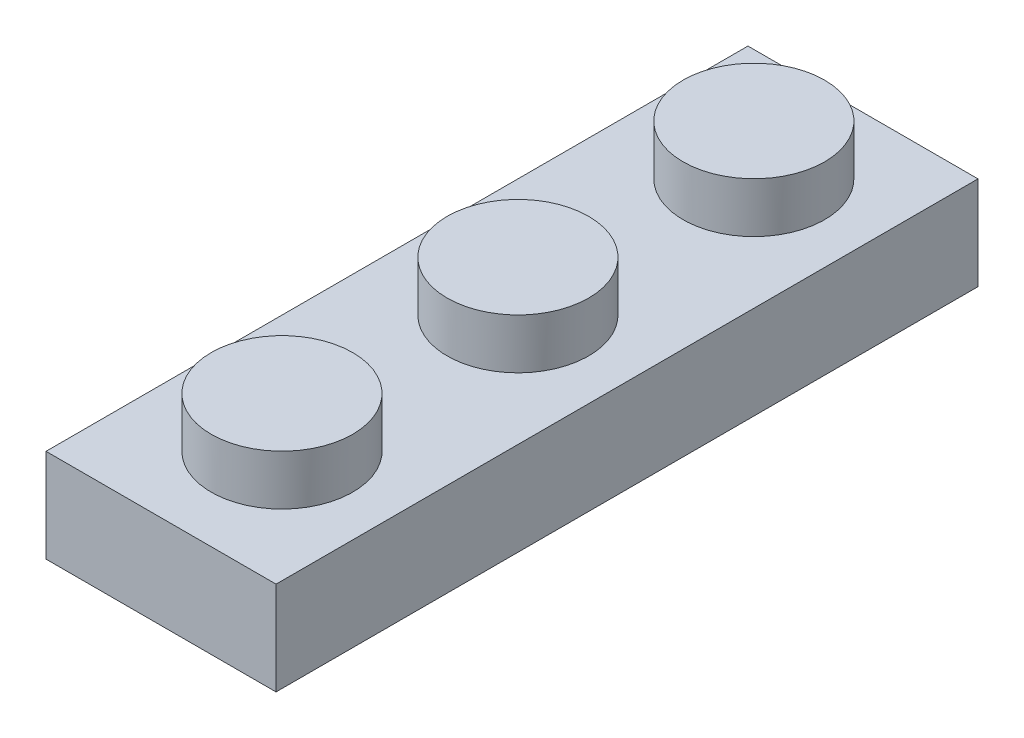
ISO-10303-21;
HEADER;
FILE_DESCRIPTION(('STEP AP214'),'2;1');
FILE_NAME('part.step','',(''),(''),'','','');
FILE_SCHEMA(('AUTOMOTIVE_DESIGN { 1 0 10303 214 1 1 1 1 }'));
ENDSEC;
DATA;
#1=APPLICATION_CONTEXT('core data for automotive mechanical design processes');
#2=APPLICATION_PROTOCOL_DEFINITION('international standard','automotive_design',2000,#1);
#3=PRODUCT_CONTEXT('',#1,'mechanical');
#4=PRODUCT('Part','Part','',(#3));
#5=PRODUCT_RELATED_PRODUCT_CATEGORY('part','',(#4));
#6=PRODUCT_DEFINITION_FORMATION('','',#4);
#7=PRODUCT_DEFINITION_CONTEXT('part definition',#1,'design');
#8=PRODUCT_DEFINITION('design','',#6,#7);
#9=PRODUCT_DEFINITION_SHAPE('','',#8);
#10=(LENGTH_UNIT() NAMED_UNIT(*) SI_UNIT(.MILLI.,.METRE.));
#11=(NAMED_UNIT(*) PLANE_ANGLE_UNIT() SI_UNIT($,.RADIAN.));
#12=(NAMED_UNIT(*) SI_UNIT($,.STERADIAN.) SOLID_ANGLE_UNIT());
#13=UNCERTAINTY_MEASURE_WITH_UNIT(LENGTH_MEASURE(1.E-05),#10,'distance_accuracy_value','');
#14=(GEOMETRIC_REPRESENTATION_CONTEXT(3) GLOBAL_UNCERTAINTY_ASSIGNED_CONTEXT((#13)) GLOBAL_UNIT_ASSIGNED_CONTEXT((#10,
#11,#12)) REPRESENTATION_CONTEXT('',''));
#15=CARTESIAN_POINT('',(0.,0.,0.));
#16=DIRECTION('',(0.,0.,1.));
#17=DIRECTION('',(1.,0.,0.));
#18=AXIS2_PLACEMENT_3D('',#15,#16,#17);
#19=CARTESIAN_POINT('',(0.,3.166,-23.8));
#20=DIRECTION('',(0.,-1.,0.));
#21=DIRECTION('',(0.,0.,-1.));
#22=AXIS2_PLACEMENT_3D('',#19,#20,#21);
#23=PLANE('',#22);
#24=CARTESIAN_POINT('',(4.,3.166,-12.));
#25=DIRECTION('',(0.,-1.,0.));
#26=DIRECTION('',(0.,0.,-1.));
#27=AXIS2_PLACEMENT_3D('',#24,#25,#26);
#28=CIRCLE('',#27,2.4);
#29=CARTESIAN_POINT('',(4.,3.166,-14.4));
#30=VERTEX_POINT('',#29);
#31=EDGE_CURVE('E45',#30,#30,#28,.F.);
#32=ORIENTED_EDGE('',*,*,#31,.F.);
#33=EDGE_LOOP('',(#32));
#34=FACE_BOUND('',#33,.T.);
#35=DIRECTION('',(0.,0.,1.));
#36=VECTOR('',#35,1.);
#37=CARTESIAN_POINT('',(0.,3.166,0.));
#38=LINE('',#37,#36);
#39=CARTESIAN_POINT('',(0.,3.166,-23.8));
#40=VERTEX_POINT('',#39);
#41=CARTESIAN_POINT('',(0.,3.166,0.));
#42=VERTEX_POINT('',#41);
#43=EDGE_CURVE('E255',#40,#42,#38,.T.);
#44=ORIENTED_EDGE('',*,*,#43,.T.);
#45=DIRECTION('',(1.,0.,0.));
#46=VECTOR('',#45,1.);
#47=CARTESIAN_POINT('',(0.,3.166,0.));
#48=LINE('',#47,#46);
#49=CARTESIAN_POINT('',(7.8,3.166,0.));
#50=VERTEX_POINT('',#49);
#51=EDGE_CURVE('E258',#42,#50,#48,.T.);
#52=ORIENTED_EDGE('',*,*,#51,.T.);
#53=DIRECTION('',(0.,0.,-1.));
#54=VECTOR('',#53,1.);
#55=CARTESIAN_POINT('',(7.8,3.166,0.));
#56=LINE('',#55,#54);
#57=CARTESIAN_POINT('',(7.8,3.166,-23.8));
#58=VERTEX_POINT('',#57);
#59=EDGE_CURVE('E261',#50,#58,#56,.T.);
#60=ORIENTED_EDGE('',*,*,#59,.T.);
#61=DIRECTION('',(-1.,0.,0.));
#62=VECTOR('',#61,1.);
#63=CARTESIAN_POINT('',(0.,3.166,-23.8));
#64=LINE('',#63,#62);
#65=EDGE_CURVE('E263',#58,#40,#64,.T.);
#66=ORIENTED_EDGE('',*,*,#65,.T.);
#67=EDGE_LOOP('',(#44,#52,#60,#66));
#68=FACE_BOUND('',#67,.T.);
#69=CARTESIAN_POINT('',(4.,3.166,-4.));
#70=DIRECTION('',(0.,-1.,0.));
#71=DIRECTION('',(0.,0.,-1.));
#72=AXIS2_PLACEMENT_3D('',#69,#70,#71);
#73=CIRCLE('',#72,2.4);
#74=CARTESIAN_POINT('',(4.,3.166,-6.4));
#75=VERTEX_POINT('',#74);
#76=EDGE_CURVE('E284',#75,#75,#73,.F.);
#77=ORIENTED_EDGE('',*,*,#76,.F.);
#78=EDGE_LOOP('',(#77));
#79=FACE_BOUND('',#78,.T.);
#80=CARTESIAN_POINT('',(4.,3.166,-20.));
#81=DIRECTION('',(0.,-1.,0.));
#82=DIRECTION('',(0.,0.,-1.));
#83=AXIS2_PLACEMENT_3D('',#80,#81,#82);
#84=CIRCLE('',#83,2.4);
#85=CARTESIAN_POINT('',(4.,3.166,-22.4));
#86=VERTEX_POINT('',#85);
#87=EDGE_CURVE('E11',#86,#86,#84,.F.);
#88=ORIENTED_EDGE('',*,*,#87,.F.);
#89=EDGE_LOOP('',(#88));
#90=FACE_BOUND('',#89,.T.);
#91=ADVANCED_FACE('F37',(#34,#68,#79,#90),#23,.F.);
#92=CARTESIAN_POINT('',(0.,3.166,0.));
#93=DIRECTION('',(1.,0.,0.));
#94=DIRECTION('',(0.,0.,-1.));
#95=AXIS2_PLACEMENT_3D('',#92,#93,#94);
#96=PLANE('',#95);
#97=DIRECTION('',(0.,0.,1.));
#98=VECTOR('',#97,1.);
#99=CARTESIAN_POINT('',(0.,0.,0.));
#100=LINE('',#99,#98);
#101=CARTESIAN_POINT('',(0.,0.,-23.8));
#102=VERTEX_POINT('',#101);
#103=CARTESIAN_POINT('',(0.,0.,0.));
#104=VERTEX_POINT('',#103);
#105=EDGE_CURVE('E254',#102,#104,#100,.T.);
#106=ORIENTED_EDGE('',*,*,#105,.T.);
#107=DIRECTION('',(0.,-1.,0.));
#108=VECTOR('',#107,1.);
#109=CARTESIAN_POINT('',(0.,3.166,0.));
#110=LINE('',#109,#108);
#111=EDGE_CURVE('E281',#42,#104,#110,.T.);
#112=ORIENTED_EDGE('',*,*,#111,.F.);
#113=ORIENTED_EDGE('',*,*,#43,.F.);
#114=DIRECTION('',(0.,-1.,0.));
#115=VECTOR('',#114,1.);
#116=CARTESIAN_POINT('',(0.,3.166,-23.8));
#117=LINE('',#116,#115);
#118=EDGE_CURVE('E265',#40,#102,#117,.T.);
#119=ORIENTED_EDGE('',*,*,#118,.T.);
#120=EDGE_LOOP('',(#106,#112,#113,#119));
#121=FACE_BOUND('',#120,.T.);
#122=ADVANCED_FACE('F39',(#121),#96,.F.);
#123=CARTESIAN_POINT('',(0.,3.166,0.));
#124=DIRECTION('',(0.,0.,-1.));
#125=DIRECTION('',(-1.,0.,0.));
#126=AXIS2_PLACEMENT_3D('',#123,#124,#125);
#127=PLANE('',#126);
#128=DIRECTION('',(1.,0.,0.));
#129=VECTOR('',#128,1.);
#130=CARTESIAN_POINT('',(0.,0.,0.));
#131=LINE('',#130,#129);
#132=CARTESIAN_POINT('',(7.8,0.,0.));
#133=VERTEX_POINT('',#132);
#134=EDGE_CURVE('E268',#104,#133,#131,.T.);
#135=ORIENTED_EDGE('',*,*,#134,.T.);
#136=DIRECTION('',(0.,-1.,0.));
#137=VECTOR('',#136,1.);
#138=CARTESIAN_POINT('',(7.8,3.166,0.));
#139=LINE('',#138,#137);
#140=EDGE_CURVE('E278',#50,#133,#139,.T.);
#141=ORIENTED_EDGE('',*,*,#140,.F.);
#142=ORIENTED_EDGE('',*,*,#51,.F.);
#143=ORIENTED_EDGE('',*,*,#111,.T.);
#144=EDGE_LOOP('',(#135,#141,#142,#143));
#145=FACE_BOUND('',#144,.T.);
#146=ADVANCED_FACE('F374',(#145),#127,.F.);
#147=CARTESIAN_POINT('',(7.8,3.166,0.));
#148=DIRECTION('',(-1.,0.,0.));
#149=DIRECTION('',(0.,0.,1.));
#150=AXIS2_PLACEMENT_3D('',#147,#148,#149);
#151=PLANE('',#150);
#152=DIRECTION('',(0.,0.,-1.));
#153=VECTOR('',#152,1.);
#154=CARTESIAN_POINT('',(7.8,0.,0.));
#155=LINE('',#154,#153);
#156=CARTESIAN_POINT('',(7.8,0.,-23.8));
#157=VERTEX_POINT('',#156);
#158=EDGE_CURVE('E270',#133,#157,#155,.T.);
#159=ORIENTED_EDGE('',*,*,#158,.T.);
#160=DIRECTION('',(0.,-1.,0.));
#161=VECTOR('',#160,1.);
#162=CARTESIAN_POINT('',(7.8,3.166,-23.8));
#163=LINE('',#162,#161);
#164=EDGE_CURVE('E275',#58,#157,#163,.T.);
#165=ORIENTED_EDGE('',*,*,#164,.F.);
#166=ORIENTED_EDGE('',*,*,#59,.F.);
#167=ORIENTED_EDGE('',*,*,#140,.T.);
#168=EDGE_LOOP('',(#159,#165,#166,#167));
#169=FACE_BOUND('',#168,.T.);
#170=ADVANCED_FACE('F371',(#169),#151,.F.);
#171=CARTESIAN_POINT('',(0.,3.166,-23.8));
#172=DIRECTION('',(0.,0.,1.));
#173=DIRECTION('',(1.,0.,0.));
#174=AXIS2_PLACEMENT_3D('',#171,#172,#173);
#175=PLANE('',#174);
#176=DIRECTION('',(-1.,0.,0.));
#177=VECTOR('',#176,1.);
#178=CARTESIAN_POINT('',(0.,0.,-23.8));
#179=LINE('',#178,#177);
#180=EDGE_CURVE('E259',#157,#102,#179,.T.);
#181=ORIENTED_EDGE('',*,*,#180,.T.);
#182=ORIENTED_EDGE('',*,*,#118,.F.);
#183=ORIENTED_EDGE('',*,*,#65,.F.);
#184=ORIENTED_EDGE('',*,*,#164,.T.);
#185=EDGE_LOOP('',(#181,#182,#183,#184));
#186=FACE_BOUND('',#185,.T.);
#187=ADVANCED_FACE('F367',(#186),#175,.F.);
#188=CARTESIAN_POINT('',(0.,0.,-23.8));
#189=DIRECTION('',(0.,-1.,0.));
#190=DIRECTION('',(0.,0.,-1.));
#191=AXIS2_PLACEMENT_3D('',#188,#189,#190);
#192=PLANE('',#191);
#193=DIRECTION('',(0.,0.,-1.));
#194=VECTOR('',#193,1.);
#195=CARTESIAN_POINT('',(1.45,0.,-1.45));
#196=LINE('',#195,#194);
#197=CARTESIAN_POINT('',(1.45,0.,-1.45));
#198=VERTEX_POINT('',#197);
#199=CARTESIAN_POINT('',(1.45,0.,-6.35));
#200=VERTEX_POINT('',#199);
#201=EDGE_CURVE('E52',#198,#200,#196,.T.);
#202=ORIENTED_EDGE('',*,*,#201,.F.);
#203=DIRECTION('',(-1.,0.,0.));
#204=VECTOR('',#203,1.);
#205=CARTESIAN_POINT('',(1.45,0.,-1.45));
#206=LINE('',#205,#204);
#207=CARTESIAN_POINT('',(6.35,0.,-1.45));
#208=VERTEX_POINT('',#207);
#209=EDGE_CURVE('E182',#208,#198,#206,.T.);
#210=ORIENTED_EDGE('',*,*,#209,.F.);
#211=DIRECTION('',(0.,0.,1.));
#212=VECTOR('',#211,1.);
#213=CARTESIAN_POINT('',(6.35,0.,-1.45));
#214=LINE('',#213,#212);
#215=CARTESIAN_POINT('',(6.35,0.,-6.35));
#216=VERTEX_POINT('',#215);
#217=EDGE_CURVE('E173',#216,#208,#214,.T.);
#218=ORIENTED_EDGE('',*,*,#217,.F.);
#219=DIRECTION('',(1.,0.,0.));
#220=VECTOR('',#219,1.);
#221=CARTESIAN_POINT('',(1.45,0.,-6.35));
#222=LINE('',#221,#220);
#223=EDGE_CURVE('E161',#200,#216,#222,.T.);
#224=ORIENTED_EDGE('',*,*,#223,.F.);
#225=EDGE_LOOP('',(#202,#210,#218,#224));
#226=FACE_BOUND('',#225,.T.);
#227=DIRECTION('',(0.,0.,-1.));
#228=VECTOR('',#227,1.);
#229=CARTESIAN_POINT('',(1.45,0.,-9.45));
#230=LINE('',#229,#228);
#231=CARTESIAN_POINT('',(1.45,0.,-9.45));
#232=VERTEX_POINT('',#231);
#233=CARTESIAN_POINT('',(1.45,0.,-14.35));
#234=VERTEX_POINT('',#233);
#235=EDGE_CURVE('E60',#232,#234,#230,.T.);
#236=ORIENTED_EDGE('',*,*,#235,.F.);
#237=DIRECTION('',(-1.,0.,0.));
#238=VECTOR('',#237,1.);
#239=CARTESIAN_POINT('',(1.45,0.,-9.45));
#240=LINE('',#239,#238);
#241=CARTESIAN_POINT('',(6.35,0.,-9.45));
#242=VERTEX_POINT('',#241);
#243=EDGE_CURVE('E211',#242,#232,#240,.T.);
#244=ORIENTED_EDGE('',*,*,#243,.F.);
#245=DIRECTION('',(0.,0.,1.));
#246=VECTOR('',#245,1.);
#247=CARTESIAN_POINT('',(6.35,0.,-9.45));
#248=LINE('',#247,#246);
#249=CARTESIAN_POINT('',(6.35,0.,-14.35));
#250=VERTEX_POINT('',#249);
#251=EDGE_CURVE('E206',#250,#242,#248,.T.);
#252=ORIENTED_EDGE('',*,*,#251,.F.);
#253=DIRECTION('',(1.,0.,0.));
#254=VECTOR('',#253,1.);
#255=CARTESIAN_POINT('',(1.45,0.,-14.35));
#256=LINE('',#255,#254);
#257=EDGE_CURVE('E190',#234,#250,#256,.T.);
#258=ORIENTED_EDGE('',*,*,#257,.F.);
#259=EDGE_LOOP('',(#236,#244,#252,#258));
#260=FACE_BOUND('',#259,.T.);
#261=DIRECTION('',(0.,0.,-1.));
#262=VECTOR('',#261,1.);
#263=CARTESIAN_POINT('',(1.45,0.,-17.45));
#264=LINE('',#263,#262);
#265=CARTESIAN_POINT('',(1.45,0.,-17.45));
#266=VERTEX_POINT('',#265);
#267=CARTESIAN_POINT('',(1.45,0.,-22.35));
#268=VERTEX_POINT('',#267);
#269=EDGE_CURVE('E219',#266,#268,#264,.T.);
#270=ORIENTED_EDGE('',*,*,#269,.F.);
#271=DIRECTION('',(-1.,0.,0.));
#272=VECTOR('',#271,1.);
#273=CARTESIAN_POINT('',(1.45,0.,-17.45));
#274=LINE('',#273,#272);
#275=CARTESIAN_POINT('',(6.35,0.,-17.45));
#276=VERTEX_POINT('',#275);
#277=EDGE_CURVE('E224',#276,#266,#274,.T.);
#278=ORIENTED_EDGE('',*,*,#277,.F.);
#279=DIRECTION('',(0.,0.,1.));
#280=VECTOR('',#279,1.);
#281=CARTESIAN_POINT('',(6.35,0.,-17.45));
#282=LINE('',#281,#280);
#283=CARTESIAN_POINT('',(6.35,0.,-22.35));
#284=VERTEX_POINT('',#283);
#285=EDGE_CURVE('E238',#284,#276,#282,.T.);
#286=ORIENTED_EDGE('',*,*,#285,.F.);
#287=DIRECTION('',(1.,0.,0.));
#288=VECTOR('',#287,1.);
#289=CARTESIAN_POINT('',(1.45,0.,-22.35));
#290=LINE('',#289,#288);
#291=EDGE_CURVE('E235',#268,#284,#290,.T.);
#292=ORIENTED_EDGE('',*,*,#291,.F.);
#293=EDGE_LOOP('',(#270,#278,#286,#292));
#294=FACE_BOUND('',#293,.T.);
#295=ORIENTED_EDGE('',*,*,#105,.F.);
#296=ORIENTED_EDGE('',*,*,#180,.F.);
#297=ORIENTED_EDGE('',*,*,#158,.F.);
#298=ORIENTED_EDGE('',*,*,#134,.F.);
#299=EDGE_LOOP('',(#295,#296,#297,#298));
#300=FACE_BOUND('',#299,.T.);
#301=ADVANCED_FACE('F362',(#226,#260,#294,#300),#192,.T.);
#302=CARTESIAN_POINT('',(4.,4.866,-4.));
#303=DIRECTION('',(0.,-1.,0.));
#304=DIRECTION('',(0.,0.,-1.));
#305=AXIS2_PLACEMENT_3D('',#302,#303,#304);
#306=CYLINDRICAL_SURFACE('',#305,2.4);
#307=CARTESIAN_POINT('',(4.,4.866,-4.));
#308=DIRECTION('',(0.,1.,0.));
#309=DIRECTION('',(0.,0.,1.));
#310=AXIS2_PLACEMENT_3D('',#307,#308,#309);
#311=CIRCLE('',#310,2.4);
#312=CARTESIAN_POINT('',(4.,4.866,-1.6));
#313=VERTEX_POINT('',#312);
#314=EDGE_CURVE('E245',#313,#313,#311,.T.);
#315=ORIENTED_EDGE('',*,*,#314,.F.);
#316=EDGE_LOOP('',(#315));
#317=FACE_BOUND('',#316,.T.);
#318=ORIENTED_EDGE('',*,*,#76,.T.);
#319=EDGE_LOOP('',(#318));
#320=FACE_BOUND('',#319,.T.);
#321=ADVANCED_FACE('F359',(#317,#320),#306,.T.);
#322=CARTESIAN_POINT('',(4.,4.866,-4.));
#323=DIRECTION('',(0.,1.,0.));
#324=DIRECTION('',(0.,0.,1.));
#325=AXIS2_PLACEMENT_3D('',#322,#323,#324);
#326=PLANE('',#325);
#327=ORIENTED_EDGE('',*,*,#314,.T.);
#328=EDGE_LOOP('',(#327));
#329=FACE_BOUND('',#328,.T.);
#330=ADVANCED_FACE('F355',(#329),#326,.T.);
#331=CARTESIAN_POINT('',(1.45,2.5,-17.45));
#332=DIRECTION('',(-1.,0.,0.));
#333=DIRECTION('',(0.,0.,1.));
#334=AXIS2_PLACEMENT_3D('',#331,#332,#333);
#335=PLANE('',#334);
#336=ORIENTED_EDGE('',*,*,#269,.T.);
#337=DIRECTION('',(0.,-1.,0.));
#338=VECTOR('',#337,1.);
#339=CARTESIAN_POINT('',(1.45,2.5,-22.35));
#340=LINE('',#339,#338);
#341=CARTESIAN_POINT('',(1.45,2.5,-22.35));
#342=VERTEX_POINT('',#341);
#343=EDGE_CURVE('E233',#342,#268,#340,.T.);
#344=ORIENTED_EDGE('',*,*,#343,.F.);
#345=DIRECTION('',(0.,0.,-1.));
#346=VECTOR('',#345,1.);
#347=CARTESIAN_POINT('',(1.45,2.5,-17.45));
#348=LINE('',#347,#346);
#349=CARTESIAN_POINT('',(1.45,2.5,-17.45));
#350=VERTEX_POINT('',#349);
#351=EDGE_CURVE('E220',#350,#342,#348,.T.);
#352=ORIENTED_EDGE('',*,*,#351,.F.);
#353=DIRECTION('',(0.,-1.,0.));
#354=VECTOR('',#353,1.);
#355=CARTESIAN_POINT('',(1.45,2.5,-17.45));
#356=LINE('',#355,#354);
#357=EDGE_CURVE('E243',#350,#266,#356,.T.);
#358=ORIENTED_EDGE('',*,*,#357,.T.);
#359=EDGE_LOOP('',(#336,#344,#352,#358));
#360=FACE_BOUND('',#359,.T.);
#361=ADVANCED_FACE('F345',(#360),#335,.F.);
#362=CARTESIAN_POINT('',(1.45,2.5,-17.45));
#363=DIRECTION('',(0.,0.,1.));
#364=DIRECTION('',(1.,0.,0.));
#365=AXIS2_PLACEMENT_3D('',#362,#363,#364);
#366=PLANE('',#365);
#367=ORIENTED_EDGE('',*,*,#277,.T.);
#368=ORIENTED_EDGE('',*,*,#357,.F.);
#369=DIRECTION('',(-1.,0.,0.));
#370=VECTOR('',#369,1.);
#371=CARTESIAN_POINT('',(1.45,2.5,-17.45));
#372=LINE('',#371,#370);
#373=CARTESIAN_POINT('',(6.35,2.5,-17.45));
#374=VERTEX_POINT('',#373);
#375=EDGE_CURVE('E230',#374,#350,#372,.T.);
#376=ORIENTED_EDGE('',*,*,#375,.F.);
#377=DIRECTION('',(0.,-1.,0.));
#378=VECTOR('',#377,1.);
#379=CARTESIAN_POINT('',(6.35,2.5,-17.45));
#380=LINE('',#379,#378);
#381=EDGE_CURVE('E246',#374,#276,#380,.T.);
#382=ORIENTED_EDGE('',*,*,#381,.T.);
#383=EDGE_LOOP('',(#367,#368,#376,#382));
#384=FACE_BOUND('',#383,.T.);
#385=ADVANCED_FACE('F341',(#384),#366,.F.);
#386=CARTESIAN_POINT('',(6.35,2.5,-17.45));
#387=DIRECTION('',(1.,0.,0.));
#388=DIRECTION('',(0.,0.,-1.));
#389=AXIS2_PLACEMENT_3D('',#386,#387,#388);
#390=PLANE('',#389);
#391=ORIENTED_EDGE('',*,*,#285,.T.);
#392=ORIENTED_EDGE('',*,*,#381,.F.);
#393=DIRECTION('',(0.,0.,1.));
#394=VECTOR('',#393,1.);
#395=CARTESIAN_POINT('',(6.35,2.5,-17.45));
#396=LINE('',#395,#394);
#397=CARTESIAN_POINT('',(6.35,2.5,-22.35));
#398=VERTEX_POINT('',#397);
#399=EDGE_CURVE('E227',#398,#374,#396,.T.);
#400=ORIENTED_EDGE('',*,*,#399,.F.);
#401=DIRECTION('',(0.,-1.,0.));
#402=VECTOR('',#401,1.);
#403=CARTESIAN_POINT('',(6.35,2.5,-22.35));
#404=LINE('',#403,#402);
#405=EDGE_CURVE('E248',#398,#284,#404,.T.);
#406=ORIENTED_EDGE('',*,*,#405,.T.);
#407=EDGE_LOOP('',(#391,#392,#400,#406));
#408=FACE_BOUND('',#407,.T.);
#409=ADVANCED_FACE('F344',(#408),#390,.F.);
#410=CARTESIAN_POINT('',(1.45,2.5,-22.35));
#411=DIRECTION('',(0.,0.,-1.));
#412=DIRECTION('',(-1.,0.,0.));
#413=AXIS2_PLACEMENT_3D('',#410,#411,#412);
#414=PLANE('',#413);
#415=ORIENTED_EDGE('',*,*,#291,.T.);
#416=ORIENTED_EDGE('',*,*,#405,.F.);
#417=DIRECTION('',(1.,0.,0.));
#418=VECTOR('',#417,1.);
#419=CARTESIAN_POINT('',(1.45,2.5,-22.35));
#420=LINE('',#419,#418);
#421=EDGE_CURVE('E223',#342,#398,#420,.T.);
#422=ORIENTED_EDGE('',*,*,#421,.F.);
#423=ORIENTED_EDGE('',*,*,#343,.T.);
#424=EDGE_LOOP('',(#415,#416,#422,#423));
#425=FACE_BOUND('',#424,.T.);
#426=ADVANCED_FACE('F339',(#425),#414,.F.);
#427=CARTESIAN_POINT('',(1.45,2.5,-22.35));
#428=DIRECTION('',(0.,-1.,0.));
#429=DIRECTION('',(0.,0.,-1.));
#430=AXIS2_PLACEMENT_3D('',#427,#428,#429);
#431=PLANE('',#430);
#432=ORIENTED_EDGE('',*,*,#351,.T.);
#433=ORIENTED_EDGE('',*,*,#421,.T.);
#434=ORIENTED_EDGE('',*,*,#399,.T.);
#435=ORIENTED_EDGE('',*,*,#375,.T.);
#436=EDGE_LOOP('',(#432,#433,#434,#435));
#437=FACE_BOUND('',#436,.T.);
#438=ADVANCED_FACE('F331',(#437),#431,.T.);
#439=CARTESIAN_POINT('',(4.,4.866,-12.));
#440=DIRECTION('',(0.,-1.,0.));
#441=DIRECTION('',(0.,0.,-1.));
#442=AXIS2_PLACEMENT_3D('',#439,#440,#441);
#443=CYLINDRICAL_SURFACE('',#442,2.4);
#444=CARTESIAN_POINT('',(4.,4.866,-12.));
#445=DIRECTION('',(0.,1.,0.));
#446=DIRECTION('',(0.,0.,1.));
#447=AXIS2_PLACEMENT_3D('',#444,#445,#446);
#448=CIRCLE('',#447,2.4);
#449=CARTESIAN_POINT('',(4.,4.866,-9.6));
#450=VERTEX_POINT('',#449);
#451=EDGE_CURVE('E216',#450,#450,#448,.T.);
#452=ORIENTED_EDGE('',*,*,#451,.F.);
#453=EDGE_LOOP('',(#452));
#454=FACE_BOUND('',#453,.T.);
#455=ORIENTED_EDGE('',*,*,#31,.T.);
#456=EDGE_LOOP('',(#455));
#457=FACE_BOUND('',#456,.T.);
#458=ADVANCED_FACE('F289',(#454,#457),#443,.T.);
#459=CARTESIAN_POINT('',(4.,4.866,-12.));
#460=DIRECTION('',(0.,1.,0.));
#461=DIRECTION('',(0.,0.,1.));
#462=AXIS2_PLACEMENT_3D('',#459,#460,#461);
#463=PLANE('',#462);
#464=ORIENTED_EDGE('',*,*,#451,.T.);
#465=EDGE_LOOP('',(#464));
#466=FACE_BOUND('',#465,.T.);
#467=ADVANCED_FACE('F320',(#466),#463,.T.);
#468=CARTESIAN_POINT('',(1.45,2.5,-9.45));
#469=DIRECTION('',(-1.,0.,0.));
#470=DIRECTION('',(0.,0.,1.));
#471=AXIS2_PLACEMENT_3D('',#468,#469,#470);
#472=PLANE('',#471);
#473=ORIENTED_EDGE('',*,*,#235,.T.);
#474=DIRECTION('',(0.,-1.,0.));
#475=VECTOR('',#474,1.);
#476=CARTESIAN_POINT('',(1.45,2.5,-14.35));
#477=LINE('',#476,#475);
#478=CARTESIAN_POINT('',(1.45,2.5,-14.35));
#479=VERTEX_POINT('',#478);
#480=EDGE_CURVE('E204',#479,#234,#477,.T.);
#481=ORIENTED_EDGE('',*,*,#480,.F.);
#482=DIRECTION('',(0.,0.,-1.));
#483=VECTOR('',#482,1.);
#484=CARTESIAN_POINT('',(1.45,2.5,-9.45));
#485=LINE('',#484,#483);
#486=CARTESIAN_POINT('',(1.45,2.5,-9.45));
#487=VERTEX_POINT('',#486);
#488=EDGE_CURVE('E192',#487,#479,#485,.T.);
#489=ORIENTED_EDGE('',*,*,#488,.F.);
#490=DIRECTION('',(0.,-1.,0.));
#491=VECTOR('',#490,1.);
#492=CARTESIAN_POINT('',(1.45,2.5,-9.45));
#493=LINE('',#492,#491);
#494=EDGE_CURVE('E213',#487,#232,#493,.T.);
#495=ORIENTED_EDGE('',*,*,#494,.T.);
#496=EDGE_LOOP('',(#473,#481,#489,#495));
#497=FACE_BOUND('',#496,.T.);
#498=ADVANCED_FACE('F307',(#497),#472,.F.);
#499=CARTESIAN_POINT('',(1.45,2.5,-9.45));
#500=DIRECTION('',(0.,0.,1.));
#501=DIRECTION('',(1.,0.,0.));
#502=AXIS2_PLACEMENT_3D('',#499,#500,#501);
#503=PLANE('',#502);
#504=ORIENTED_EDGE('',*,*,#243,.T.);
#505=ORIENTED_EDGE('',*,*,#494,.F.);
#506=DIRECTION('',(-1.,0.,0.));
#507=VECTOR('',#506,1.);
#508=CARTESIAN_POINT('',(1.45,2.5,-9.45));
#509=LINE('',#508,#507);
#510=CARTESIAN_POINT('',(6.35,2.5,-9.45));
#511=VERTEX_POINT('',#510);
#512=EDGE_CURVE('E198',#511,#487,#509,.T.);
#513=ORIENTED_EDGE('',*,*,#512,.F.);
#514=DIRECTION('',(0.,-1.,0.));
#515=VECTOR('',#514,1.);
#516=CARTESIAN_POINT('',(6.35,2.5,-9.45));
#517=LINE('',#516,#515);
#518=EDGE_CURVE('E208',#511,#242,#517,.T.);
#519=ORIENTED_EDGE('',*,*,#518,.T.);
#520=EDGE_LOOP('',(#504,#505,#513,#519));
#521=FACE_BOUND('',#520,.T.);
#522=ADVANCED_FACE('F319',(#521),#503,.F.);
#523=CARTESIAN_POINT('',(6.35,2.5,-9.45));
#524=DIRECTION('',(1.,0.,0.));
#525=DIRECTION('',(0.,0.,-1.));
#526=AXIS2_PLACEMENT_3D('',#523,#524,#525);
#527=PLANE('',#526);
#528=ORIENTED_EDGE('',*,*,#251,.T.);
#529=ORIENTED_EDGE('',*,*,#518,.F.);
#530=DIRECTION('',(0.,0.,1.));
#531=VECTOR('',#530,1.);
#532=CARTESIAN_POINT('',(6.35,2.5,-9.45));
#533=LINE('',#532,#531);
#534=CARTESIAN_POINT('',(6.35,2.5,-14.35));
#535=VERTEX_POINT('',#534);
#536=EDGE_CURVE('E196',#535,#511,#533,.T.);
#537=ORIENTED_EDGE('',*,*,#536,.F.);
#538=DIRECTION('',(0.,-1.,0.));
#539=VECTOR('',#538,1.);
#540=CARTESIAN_POINT('',(6.35,2.5,-14.35));
#541=LINE('',#540,#539);
#542=EDGE_CURVE('E201',#535,#250,#541,.T.);
#543=ORIENTED_EDGE('',*,*,#542,.T.);
#544=EDGE_LOOP('',(#528,#529,#537,#543));
#545=FACE_BOUND('',#544,.T.);
#546=ADVANCED_FACE('F326',(#545),#527,.F.);
#547=CARTESIAN_POINT('',(1.45,2.5,-14.35));
#548=DIRECTION('',(0.,0.,-1.));
#549=DIRECTION('',(-1.,0.,0.));
#550=AXIS2_PLACEMENT_3D('',#547,#548,#549);
#551=PLANE('',#550);
#552=ORIENTED_EDGE('',*,*,#257,.T.);
#553=ORIENTED_EDGE('',*,*,#542,.F.);
#554=DIRECTION('',(1.,0.,0.));
#555=VECTOR('',#554,1.);
#556=CARTESIAN_POINT('',(1.45,2.5,-14.35));
#557=LINE('',#556,#555);
#558=EDGE_CURVE('E194',#479,#535,#557,.T.);
#559=ORIENTED_EDGE('',*,*,#558,.F.);
#560=ORIENTED_EDGE('',*,*,#480,.T.);
#561=EDGE_LOOP('',(#552,#553,#559,#560));
#562=FACE_BOUND('',#561,.T.);
#563=ADVANCED_FACE('F314',(#562),#551,.F.);
#564=CARTESIAN_POINT('',(1.45,2.5,-14.35));
#565=DIRECTION('',(0.,-1.,0.));
#566=DIRECTION('',(0.,0.,-1.));
#567=AXIS2_PLACEMENT_3D('',#564,#565,#566);
#568=PLANE('',#567);
#569=ORIENTED_EDGE('',*,*,#488,.T.);
#570=ORIENTED_EDGE('',*,*,#558,.T.);
#571=ORIENTED_EDGE('',*,*,#536,.T.);
#572=ORIENTED_EDGE('',*,*,#512,.T.);
#573=EDGE_LOOP('',(#569,#570,#571,#572));
#574=FACE_BOUND('',#573,.T.);
#575=ADVANCED_FACE('F304',(#574),#568,.T.);
#576=CARTESIAN_POINT('',(4.,4.866,-20.));
#577=DIRECTION('',(0.,-1.,0.));
#578=DIRECTION('',(0.,0.,-1.));
#579=AXIS2_PLACEMENT_3D('',#576,#577,#578);
#580=CYLINDRICAL_SURFACE('',#579,2.4);
#581=CARTESIAN_POINT('',(4.,4.866,-20.));
#582=DIRECTION('',(0.,1.,0.));
#583=DIRECTION('',(0.,0.,1.));
#584=AXIS2_PLACEMENT_3D('',#581,#582,#583);
#585=CIRCLE('',#584,2.4);
#586=CARTESIAN_POINT('',(4.,4.866,-17.6));
#587=VERTEX_POINT('',#586);
#588=EDGE_CURVE('E187',#587,#587,#585,.T.);
#589=ORIENTED_EDGE('',*,*,#588,.F.);
#590=EDGE_LOOP('',(#589));
#591=FACE_BOUND('',#590,.T.);
#592=ORIENTED_EDGE('',*,*,#87,.T.);
#593=EDGE_LOOP('',(#592));
#594=FACE_BOUND('',#593,.T.);
#595=ADVANCED_FACE('F301',(#591,#594),#580,.T.);
#596=CARTESIAN_POINT('',(4.,4.866,-20.));
#597=DIRECTION('',(0.,1.,0.));
#598=DIRECTION('',(0.,0.,1.));
#599=AXIS2_PLACEMENT_3D('',#596,#597,#598);
#600=PLANE('',#599);
#601=ORIENTED_EDGE('',*,*,#588,.T.);
#602=EDGE_LOOP('',(#601));
#603=FACE_BOUND('',#602,.T.);
#604=ADVANCED_FACE('F303',(#603),#600,.T.);
#605=CARTESIAN_POINT('',(1.45,2.5,-1.45));
#606=DIRECTION('',(-1.,0.,0.));
#607=DIRECTION('',(0.,0.,1.));
#608=AXIS2_PLACEMENT_3D('',#605,#606,#607);
#609=PLANE('',#608);
#610=ORIENTED_EDGE('',*,*,#201,.T.);
#611=DIRECTION('',(0.,-1.,0.));
#612=VECTOR('',#611,1.);
#613=CARTESIAN_POINT('',(1.45,2.5,-6.35));
#614=LINE('',#613,#612);
#615=CARTESIAN_POINT('',(1.45,2.5,-6.35));
#616=VERTEX_POINT('',#615);
#617=EDGE_CURVE('E166',#616,#200,#614,.T.);
#618=ORIENTED_EDGE('',*,*,#617,.F.);
#619=DIRECTION('',(0.,0.,-1.));
#620=VECTOR('',#619,1.);
#621=CARTESIAN_POINT('',(1.45,2.5,-1.45));
#622=LINE('',#621,#620);
#623=CARTESIAN_POINT('',(1.45,2.5,-1.45));
#624=VERTEX_POINT('',#623);
#625=EDGE_CURVE('E153',#624,#616,#622,.T.);
#626=ORIENTED_EDGE('',*,*,#625,.F.);
#627=DIRECTION('',(0.,-1.,0.));
#628=VECTOR('',#627,1.);
#629=CARTESIAN_POINT('',(1.45,2.5,-1.45));
#630=LINE('',#629,#628);
#631=EDGE_CURVE('E184',#624,#198,#630,.T.);
#632=ORIENTED_EDGE('',*,*,#631,.T.);
#633=EDGE_LOOP('',(#610,#618,#626,#632));
#634=FACE_BOUND('',#633,.T.);
#635=ADVANCED_FACE('F172',(#634),#609,.F.);
#636=CARTESIAN_POINT('',(1.45,2.5,-1.45));
#637=DIRECTION('',(0.,0.,1.));
#638=DIRECTION('',(1.,0.,0.));
#639=AXIS2_PLACEMENT_3D('',#636,#637,#638);
#640=PLANE('',#639);
#641=ORIENTED_EDGE('',*,*,#209,.T.);
#642=ORIENTED_EDGE('',*,*,#631,.F.);
#643=DIRECTION('',(-1.,0.,0.));
#644=VECTOR('',#643,1.);
#645=CARTESIAN_POINT('',(1.45,2.5,-1.45));
#646=LINE('',#645,#644);
#647=CARTESIAN_POINT('',(6.35,2.5,-1.45));
#648=VERTEX_POINT('',#647);
#649=EDGE_CURVE('E159',#648,#624,#646,.T.);
#650=ORIENTED_EDGE('',*,*,#649,.F.);
#651=DIRECTION('',(0.,-1.,0.));
#652=VECTOR('',#651,1.);
#653=CARTESIAN_POINT('',(6.35,2.5,-1.45));
#654=LINE('',#653,#652);
#655=EDGE_CURVE('E175',#648,#208,#654,.T.);
#656=ORIENTED_EDGE('',*,*,#655,.T.);
#657=EDGE_LOOP('',(#641,#642,#650,#656));
#658=FACE_BOUND('',#657,.T.);
#659=ADVANCED_FACE('F428',(#658),#640,.F.);
#660=CARTESIAN_POINT('',(6.35,2.5,-1.45));
#661=DIRECTION('',(1.,0.,0.));
#662=DIRECTION('',(0.,0.,-1.));
#663=AXIS2_PLACEMENT_3D('',#660,#661,#662);
#664=PLANE('',#663);
#665=ORIENTED_EDGE('',*,*,#217,.T.);
#666=ORIENTED_EDGE('',*,*,#655,.F.);
#667=DIRECTION('',(0.,0.,1.));
#668=VECTOR('',#667,1.);
#669=CARTESIAN_POINT('',(6.35,2.5,-1.45));
#670=LINE('',#669,#668);
#671=CARTESIAN_POINT('',(6.35,2.5,-6.35));
#672=VERTEX_POINT('',#671);
#673=EDGE_CURVE('E170',#672,#648,#670,.T.);
#674=ORIENTED_EDGE('',*,*,#673,.F.);
#675=DIRECTION('',(0.,-1.,0.));
#676=VECTOR('',#675,1.);
#677=CARTESIAN_POINT('',(6.35,2.5,-6.35));
#678=LINE('',#677,#676);
#679=EDGE_CURVE('E169',#672,#216,#678,.T.);
#680=ORIENTED_EDGE('',*,*,#679,.T.);
#681=EDGE_LOOP('',(#665,#666,#674,#680));
#682=FACE_BOUND('',#681,.T.);
#683=ADVANCED_FACE('F437',(#682),#664,.F.);
#684=CARTESIAN_POINT('',(1.45,2.5,-6.35));
#685=DIRECTION('',(0.,0.,-1.));
#686=DIRECTION('',(-1.,0.,0.));
#687=AXIS2_PLACEMENT_3D('',#684,#685,#686);
#688=PLANE('',#687);
#689=ORIENTED_EDGE('',*,*,#223,.T.);
#690=ORIENTED_EDGE('',*,*,#679,.F.);
#691=DIRECTION('',(1.,0.,0.));
#692=VECTOR('',#691,1.);
#693=CARTESIAN_POINT('',(1.45,2.5,-6.35));
#694=LINE('',#693,#692);
#695=EDGE_CURVE('E156',#616,#672,#694,.T.);
#696=ORIENTED_EDGE('',*,*,#695,.F.);
#697=ORIENTED_EDGE('',*,*,#617,.T.);
#698=EDGE_LOOP('',(#689,#690,#696,#697));
#699=FACE_BOUND('',#698,.T.);
#700=ADVANCED_FACE('F165',(#699),#688,.F.);
#701=CARTESIAN_POINT('',(1.45,2.5,-6.35));
#702=DIRECTION('',(0.,-1.,0.));
#703=DIRECTION('',(0.,0.,-1.));
#704=AXIS2_PLACEMENT_3D('',#701,#702,#703);
#705=PLANE('',#704);
#706=ORIENTED_EDGE('',*,*,#625,.T.);
#707=ORIENTED_EDGE('',*,*,#695,.T.);
#708=ORIENTED_EDGE('',*,*,#673,.T.);
#709=ORIENTED_EDGE('',*,*,#649,.T.);
#710=EDGE_LOOP('',(#706,#707,#708,#709));
#711=FACE_BOUND('',#710,.T.);
#712=ADVANCED_FACE('F155',(#711),#705,.T.);
#713=CLOSED_SHELL('',(#91,#122,#146,#170,#187,#301,#321,#330,#361,#385,#409,#426,#438,#458,#467,
#498,#522,#546,#563,#575,#595,#604,#635,#659,#683,#700,#712));
#714=MANIFOLD_SOLID_BREP('B2',#713);
#715=ADVANCED_BREP_SHAPE_REPRESENTATION('',(#18,#714),#14);
#716=SHAPE_DEFINITION_REPRESENTATION(#9,#715);
ENDSEC;
END-ISO-10303-21;
